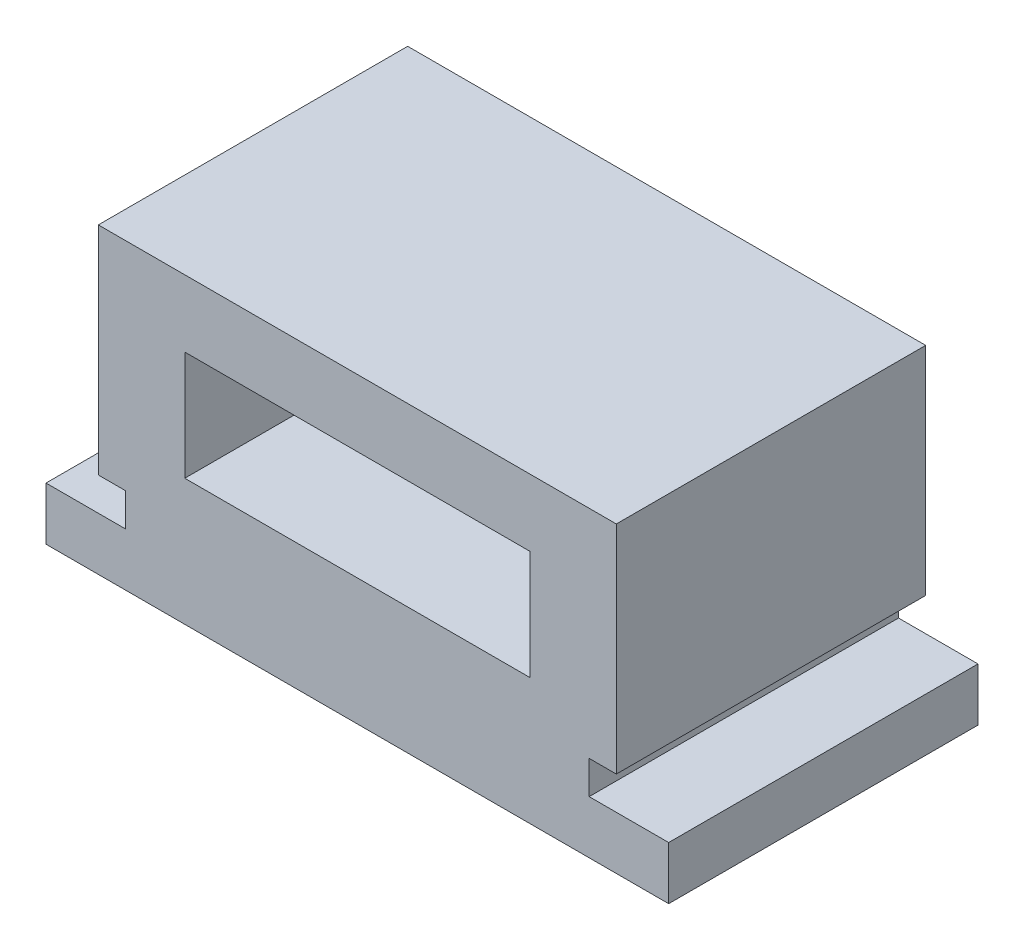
from build123d import *

# Parameters (mm, degrees)
SKETCH_1_W      = 5.21
SKETCH_1_H      = 1.65
EXTRUDE_1_DEPTH = 4.67


with BuildPart() as part:
    # Sketch 1 → Extrude 1 (new body)
    with BuildSketch(Plane.XY):
        Polygon((-4.7, 0), (4.7, 0), (4.7, 0.8), (3.5, 0.8), (3.5, 1.3), (3.91, 1.3), (3.91, 4.57), (-3.91, 4.57), (-3.91, 1.3), (-3.5, 1.3), (-3.5, 0.8), (-4.7, 0.8), align=None)
        with Locations((0, 2.735)):
            Rectangle(SKETCH_1_W, SKETCH_1_H, mode=Mode.SUBTRACT)
    extrude(amount=-EXTRUDE_1_DEPTH)


solid = part.part
